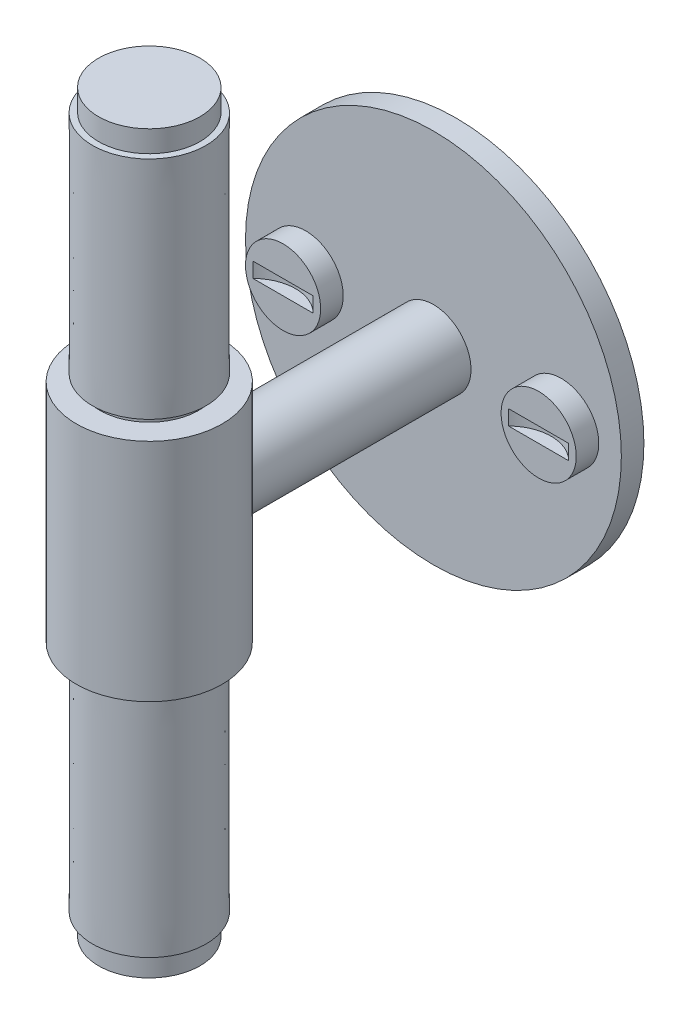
from build123d import *

# Parameters (mm, degrees)
BODY_MOVE_COPY2_ANGLE = 90
BODY_MOVE_COPY3_ANGLE = 90
SKETCH2_R             = 5
BOSS_EXTRUDE2_DEPTH   = 40
SKETCH3_R             = 25
BOSS_EXTRUDE3_DEPTH   = 3
SKETCH4_R             = 5
BOSS_EXTRUDE4_DEPTH   = 3
CUT_EXTRUDE1_DEPTH    = 1


with BuildPart() as part:
    # Sketch1 → Revolve1 (revolve)
    with BuildSketch(Plane(origin=(0, 0, 0), x_dir=(0, 0, -1), z_dir=(1, 0, 0)), mode=Mode.PRIVATE) as revolve1_sk:
        Polygon((-12.800139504, 9.706211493), (17.199860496, 9.706211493), (17.199860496, 6.591683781), (18.199860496, 6.591683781), (18.199860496, 7.55), (48.19986048, 7.548997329), (48.239901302, 6.75), (51.114849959, 6.75), (51.114849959, 0), (-46.715128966, 0), (-46.715128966, 6.75), (-43.840180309, 6.75), (-43.800139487, 7.548997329), (-13.800139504, 7.55), (-13.800139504, 6.591683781), (-12.800139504, 6.591683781), align=None)
    revolve(revolve1_sk.sketch.rotate(Axis((0, 0, 46.715128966), (0, 0, -1)), 90), axis=Axis((0, 0, 46.715128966), (0, 0, -1)))


with BuildPart() as part_1:
    # Body-Move_Copy2: moved
    add(part.part.rotate(Axis((0, 0, -2.199860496), (0, 1, 0)), BODY_MOVE_COPY2_ANGLE))


with BuildPart() as part_2:
    # Body-Move_Copy3: moved
    add(part_1.part.rotate(Axis((0, 0, 0), (0, 0, 1)), BODY_MOVE_COPY3_ANGLE))

    # Sketch2 → Boss-Extrude2 (add)
    with BuildSketch(Plane.XY):
        Circle(SKETCH2_R)
    extrude(amount=-BOSS_EXTRUDE2_DEPTH)

    # Sketch3 → Boss-Extrude3 (add)
    with BuildSketch(Plane(origin=(0, 0, -40), x_dir=(-1, 0, 0), z_dir=(0, 0, -1))):
        Circle(SKETCH3_R)
    extrude(amount=BOSS_EXTRUDE3_DEPTH)

    # Sketch4 → Boss-Extrude4 (add)
    with BuildSketch(Plane.XY.offset(-40)):
        with Locations(Location((17, 0, 0), (0, 0, 180))):
            Circle(SKETCH4_R)
    boss_extrude4 = extrude(amount=BOSS_EXTRUDE4_DEPTH)

    # Sketch7 → Cut-Extrude1 (cut, symmetric)
    with BuildSketch(Plane(origin=(0, 0, 0), x_dir=(1, 0, 0), z_dir=(0, 1, 0))):
        with BuildLine():
            Line((13, 37), (13, 35.948097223))
            Line((13, 35.948097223), (21, 35.948097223))
            Line((21, 35.948097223), (21, 37))
            ThreePointArc((21, 37), (17, 38.656854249), (13, 37))
        make_face()
    cut_extrude1 = extrude(amount=CUT_EXTRUDE1_DEPTH, both=True, mode=Mode.SUBTRACT)

    # Mirror2: Boss-Extrude4, Cut-Extrude1 across plane
    add(boss_extrude4.mirror(Plane(origin=(0, 0, 0), x_dir=(0, 0, 1), z_dir=(1, 0, 0))))
    add(cut_extrude1.mirror(Plane(origin=(0, 0, 0), x_dir=(0, 0, 1), z_dir=(1, 0, 0))), mode=Mode.SUBTRACT)


solid = part_2.part
